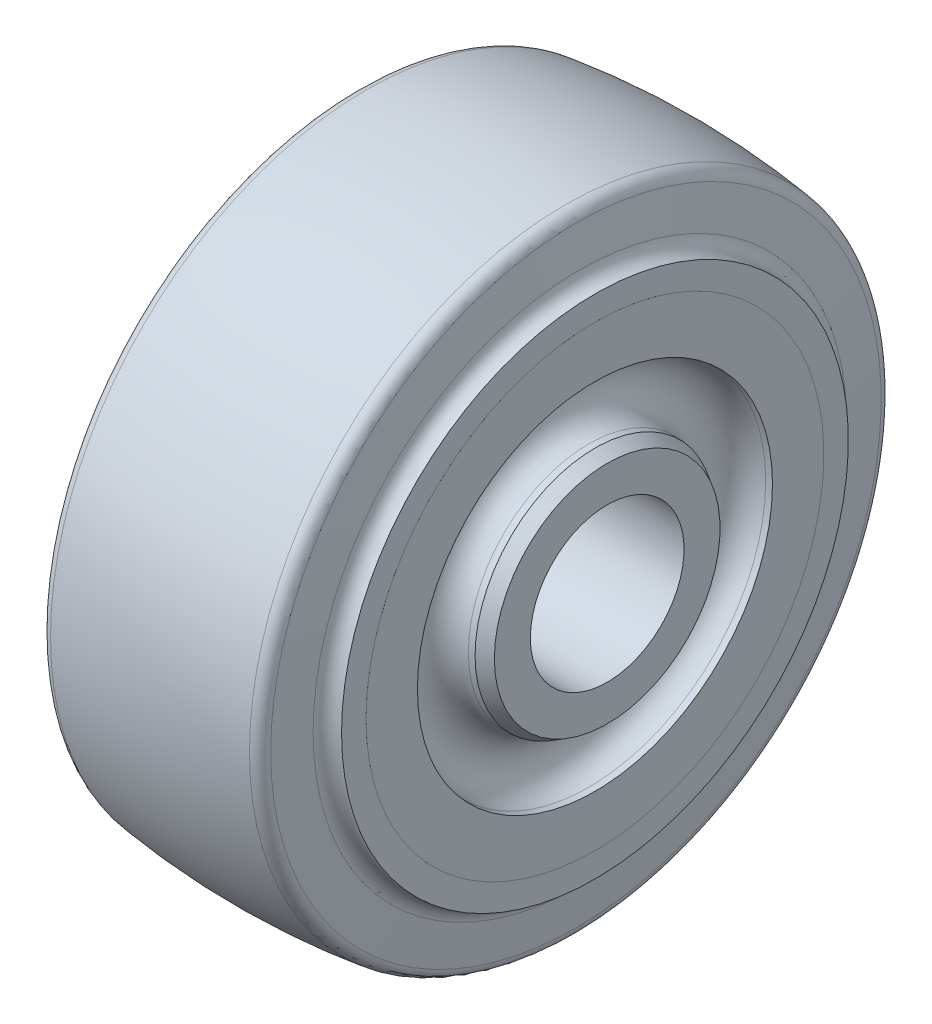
from build123d import *


with BuildPart() as part:
    # Sketch1 → Revolve1 (revolve)
    with BuildSketch(Plane.XY, mode=Mode.PRIVATE) as revolve1_sk:
        with BuildLine():
            Line((27.813, 22.225), (25.4, 23.618146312))
            Line((25.4, 23.618146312), (24.182723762, 23.724644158))
            ThreePointArc((24.182723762, 23.724644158), (19.08175, 29.291380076), (24.182723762, 34.858115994))
            Line((24.182723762, 34.858115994), (25.4, 34.96461384))
            Line((25.4, 34.96461384), (25.4, 45.085))
            Line((25.4, 45.085), (25.39746, 45.085))
            Line((25.39746, 45.085), (25.39746, 49.911))
            ThreePointArc((25.39746, 49.911), (23.416351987, 50.67147612), (22.452959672, 52.562240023))
            Line((22.452959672, 52.562240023), (21.658367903, 60.122276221))
            ThreePointArc((21.658367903, 60.122276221), (20.994229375, 61.536650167), (19.596355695, 62.234849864))
            ThreePointArc((19.596355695, 62.234849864), (0, 63.5), (-19.596355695, 62.234849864))
            ThreePointArc((-19.596355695, 62.234849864), (-20.994229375, 61.536650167), (-21.658367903, 60.122276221))
            Line((-21.658367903, 60.122276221), (-22.452959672, 52.562240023))
            ThreePointArc((-22.452959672, 52.562240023), (-23.416351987, 50.67147612), (-25.39746, 49.911))
            Line((-25.39746, 49.911), (-25.39746, 45.085))
            Line((-25.39746, 45.085), (-25.4, 45.085))
            Line((-25.4, 45.085), (-25.4, 34.96461384))
            Line((-25.4, 34.96461384), (-24.182723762, 34.858115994))
            ThreePointArc((-24.182723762, 34.858115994), (-19.08175, 29.291380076), (-24.182723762, 23.724644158))
            Line((-24.182723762, 23.724644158), (-25.4, 23.618146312))
            Line((-25.4, 23.618146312), (-27.813, 22.225))
            Line((-27.813, 22.225), (-27.813, 15.1384))
            Line((-27.813, 15.1384), (27.813, 15.1384))
            Line((27.813, 15.1384), (27.813, 22.225))
        make_face()
    revolve(revolve1_sk.sketch.rotate(Axis((-38.862204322, 0, 0), (1, 0, 0)), 90), axis=Axis((-38.862204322, 0, 0), (1, 0, 0)))


solid = part.part
